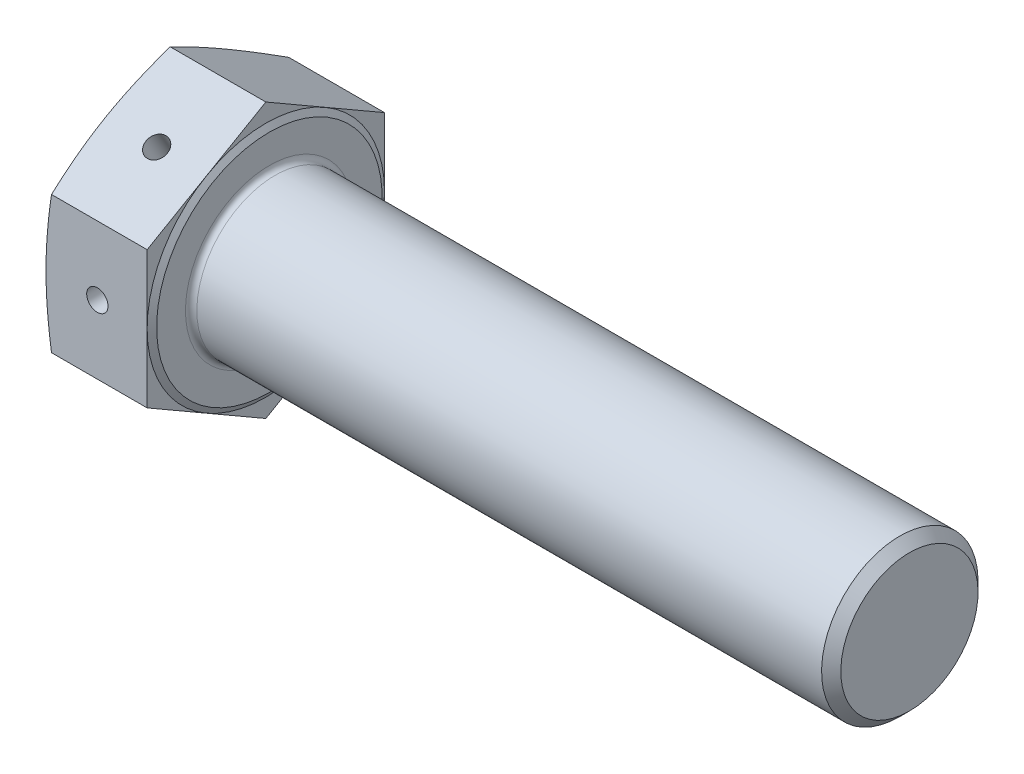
from build123d import *

# Parameters (mm, degrees)
BASEHEAD_DEPTH    = 14.22
SKETCH3_R         = 11
BASEBODY_DEPTH    = 90
CHAMFER1_SIZE     = 1.353
HEADFILLET_R      = 0.8
SKETCH5_R         = 1.5
HOLE_DEPTH        = 108.778674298
CIRPATTERN1_COUNT = 2
CIRPATTERN1_ANGLE = 60


with BuildPart() as part:
    # Sketch-BaseHead → BaseHead (new body)
    with BuildSketch(Plane(origin=(0, 0, 0), x_dir=(0, 0, -1), z_dir=(1, 0, 0))):
        Polygon((0, -19.271951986), (16.69, -9.635975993), (16.69, 9.635975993), (0, 19.271951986), (-16.69, 9.635975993), (-16.69, -9.635975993), align=None)
    extrude(amount=BASEHEAD_DEPTH)

    # Sketch4 → HeadChamfer (revolve, cut)
    with BuildSketch(Plane(origin=(-0.264637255, -5.916896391, 0), x_dir=(0, 1, 0), z_dir=(0, 0, 1))):
        Polygon((25.188848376, -0.264637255), (22.606896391, -0.264637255), (25.188848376, -1.038768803), align=None)
    revolve(axis=Axis((-4.001564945, 0, 0), (1, 0, 0)), mode=Mode.SUBTRACT)

    # Sketch2 → Revolve1 (revolve)
    with BuildSketch(Plane(origin=(0, 0, 0), x_dir=(1, 0, 0), z_dir=(0, 1, 0)), mode=Mode.PRIVATE) as revolve1_sk:
        Polygon((14.22, 0), (14.72, 0), (14.72, 15.855), (14.22, 16.69), align=None)
    revolve(revolve1_sk.sketch.rotate(Axis((-4.001564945, 0, 0), (1, 0, 0)), 270), axis=Axis((-4.001564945, 0, 0), (1, 0, 0)))

    # Sketch3 → BaseBody (add)
    with BuildSketch(Plane(origin=(14.72, 0, 0), x_dir=(0, 0, -1), z_dir=(1, 0, 0))):
        with Locations(Location((0, 0, 0), (0, 0, 270))):
            Circle(SKETCH3_R)
    extrude(amount=BASEBODY_DEPTH)

    # Chamfer1
    chamfer1_edges = [part.edges().sort_by_distance(p)[0] for p in [
        (104.72, 11, 0),
    ]]
    chamfer(chamfer1_edges, length=CHAMFER1_SIZE)

    # HeadFillet
    headfillet_edges = [part.edges().sort_by_distance(p)[0] for p in [
        (14.72, 11, 0),
    ]]
    fillet(headfillet_edges, radius=HEADFILLET_R)

    # Sketch5 → Hole (cut, symmetric)
    with BuildSketch(Plane.XY):
        with Locations((7.22, 0)):
            Circle(SKETCH5_R)
    hole = extrude(amount=HOLE_DEPTH, both=True, mode=Mode.SUBTRACT)

    # CirPattern1: Hole ×2 about axis
    cirpattern1_axis = Axis((104.72, 0, 0), (-1, 0, 0))
    for i in range(1, CIRPATTERN1_COUNT):
        add(hole.rotate(cirpattern1_axis, i * CIRPATTERN1_ANGLE / (CIRPATTERN1_COUNT - 1)), mode=Mode.SUBTRACT)


solid = part.part
